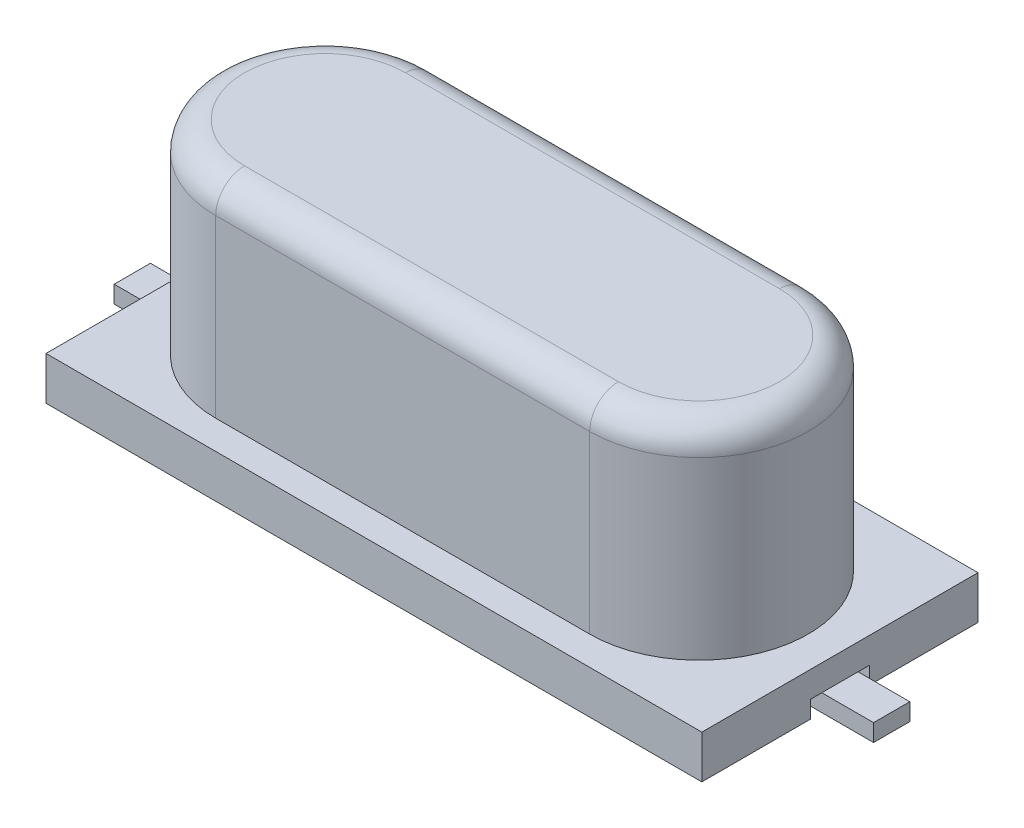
from build123d import *

# Parameters (mm, degrees)
SKETCH_1_W        = 4.4
SKETCH_1_H        = 0.63
EXTRUDE_1_DEPTH   = 0.3
EXTRUDE_1_2_DEPTH = 0.3
EXTRUDE_2_DEPTH   = 0.3
SKETCH_3_W        = 11.4
SKETCH_3_H        = 4.8
EXTRUDE_3_DEPTH   = 0.45
EXTRUDE_4_DEPTH   = 3.55
FILLET_1_R        = 0.5


with BuildPart() as part:
    # Sketch 1 → Extrude 1 (new body)
    with BuildSketch(Plane(origin=(0, 0, 0), x_dir=(1, 0, 0), z_dir=(0, 1, 0))):
        with Locations((-4.4, 0)):
            Rectangle(SKETCH_1_W, SKETCH_1_H)
    extrude(amount=EXTRUDE_1_DEPTH)



with BuildPart() as body_2:
    # Sketch 1 → Extrude 1 2 (new body)
    with BuildSketch(Plane(origin=(0, 0, 0), x_dir=(1, 0, 0), z_dir=(0, 1, 0))):
        with Locations((4.4, 0)):
            Rectangle(SKETCH_1_W, SKETCH_1_H)
    extrude(amount=EXTRUDE_1_2_DEPTH)


with BuildPart() as body_3:
    # Sketch 2 → Extrude 2 (new body)
    with BuildSketch(Plane(origin=(0, 0, 0), x_dir=(1, 0, 0), z_dir=(0, 1, 0))):
        Polygon((2, 0.515), (2, -0.515), (5.7, -0.515), (5.7, -2.4), (-5.7, -2.4), (-5.7, -0.515), (-2, -0.515), (-2, 0.515), (-5.7, 0.515), (-5.7, 2.4), (5.7, 2.4), (5.7, 0.515), align=None)
    extrude(amount=EXTRUDE_2_DEPTH)


with BuildPart() as part_1:
    add(part.part)

    add(body_2.part)  # Extrude 3 merges body 2

    add(body_3.part)  # Extrude 3 merges body 3
    # Sketch 3 → Extrude 3 (add)
    with BuildSketch(Plane(origin=(0, 0.3, 0), x_dir=(-1, 0, 0), z_dir=(0, 1, 0))):
        Rectangle(SKETCH_3_W, SKETCH_3_H)
    extrude(amount=EXTRUDE_3_DEPTH)

    # Sketch 4 → Extrude 4 (add)
    with BuildSketch(Plane(origin=(0, 0.75, 0), x_dir=(-1, 0, 0), z_dir=(0, 1, 0))):
        with BuildLine():
            Line((3.25, -1.9), (-3.25, -1.9))
            ThreePointArc((-3.25, -1.9), (-5.15, 0), (-3.25, 1.9))
            Line((-3.25, 1.9), (3.25, 1.9))
            ThreePointArc((3.25, 1.9), (5.15, 0), (3.25, -1.9))
        make_face()
    extrude(amount=EXTRUDE_4_DEPTH)

    # Fillet 1
    fillet_1_edges = [part_1.edges().sort_by_distance(p)[0] for p in [
        (-5.15, 4.3, 0),
        (0, 4.3, 1.9),
        (5.15, 4.3, 0),
        (0, 4.3, -1.9),
    ]]
    fillet(fillet_1_edges, radius=FILLET_1_R)


solid = part_1.part
